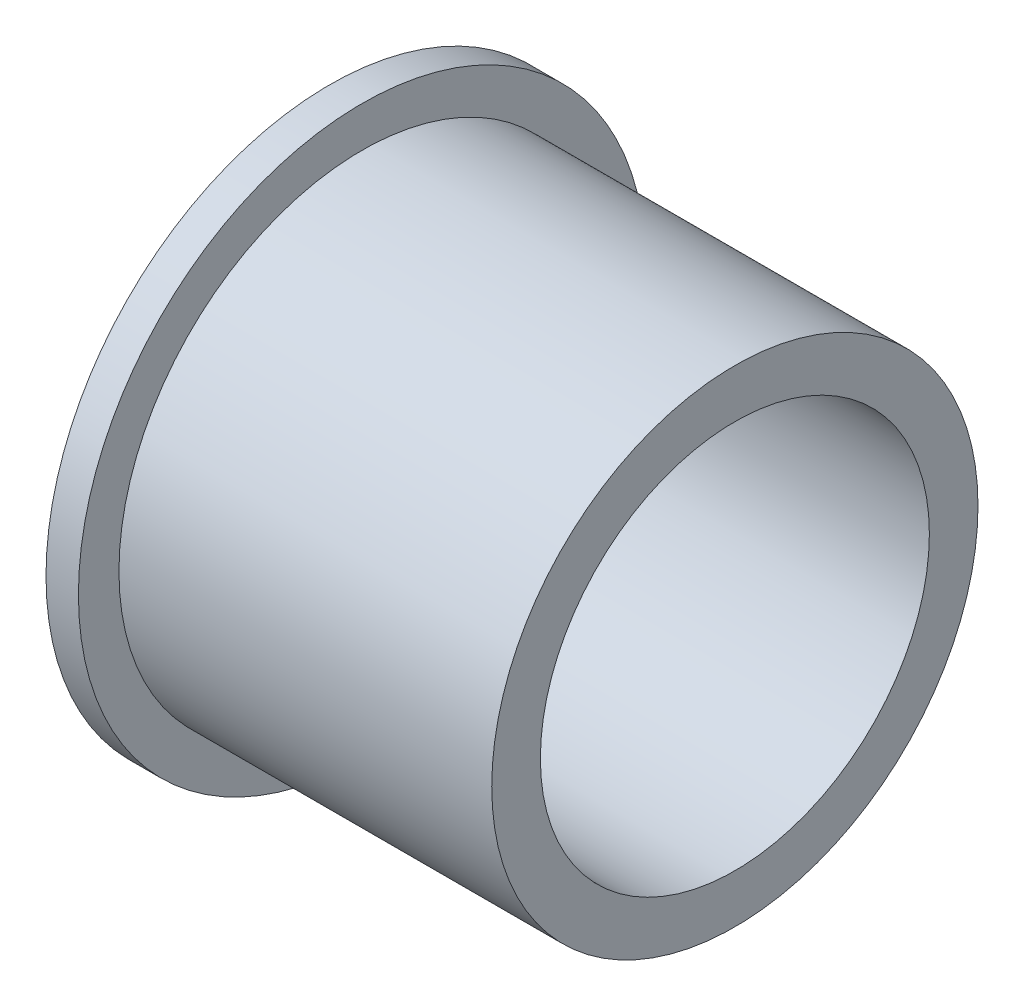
from build123d import *


with BuildPart() as part:
    # Esquisse1 → Base-R_volution (revolve)
    with BuildSketch(Plane.XY, mode=Mode.PRIVATE) as base_r_volution_sk:
        Polygon((-10.5, 17.5), (-10.5, 15), (12.5, 15), (12.5, 12), (-12.5, 12), (-12.5, 17.5), align=None)
    revolve(base_r_volution_sk.sketch.rotate(Axis((-12.5, 0, 0), (1, 0, 0)), 90), axis=Axis((-12.5, 0, 0), (1, 0, 0)))


solid = part.part
